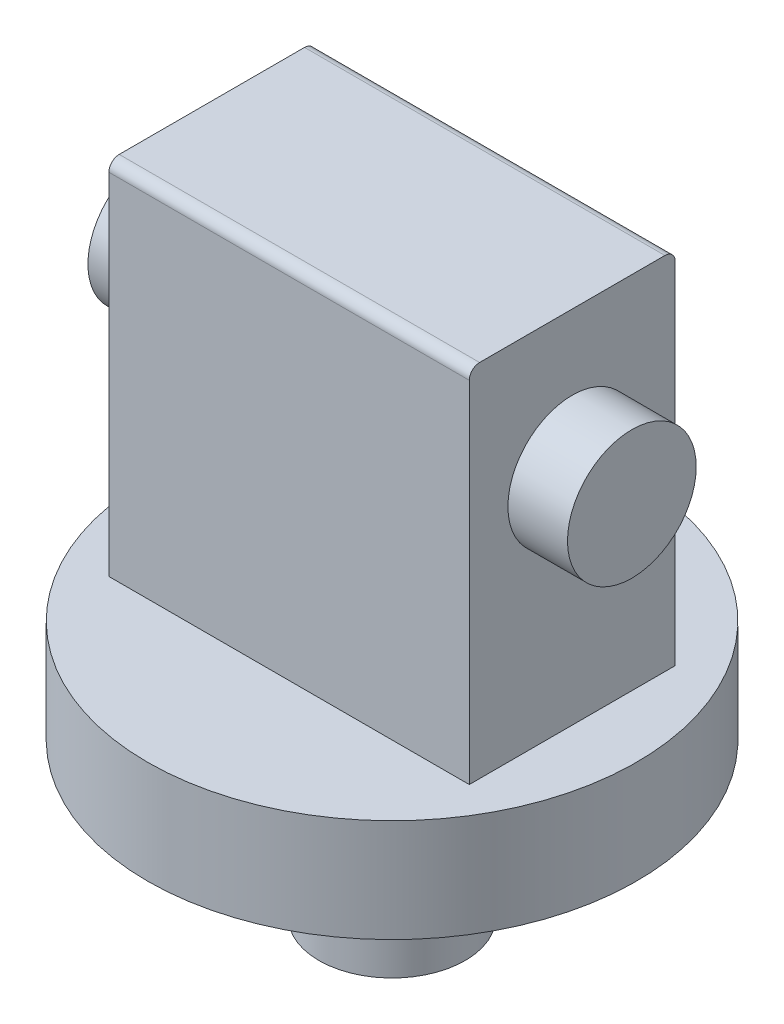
ISO-10303-21;
HEADER;
FILE_DESCRIPTION(('STEP AP214'),'2;1');
FILE_NAME('part.step','',(''),(''),'','','');
FILE_SCHEMA(('AUTOMOTIVE_DESIGN { 1 0 10303 214 1 1 1 1 }'));
ENDSEC;
DATA;
#1=APPLICATION_CONTEXT('core data for automotive mechanical design processes');
#2=APPLICATION_PROTOCOL_DEFINITION('international standard','automotive_design',2000,#1);
#3=PRODUCT_CONTEXT('',#1,'mechanical');
#4=PRODUCT('Part','Part','',(#3));
#5=PRODUCT_RELATED_PRODUCT_CATEGORY('part','',(#4));
#6=PRODUCT_DEFINITION_FORMATION('','',#4);
#7=PRODUCT_DEFINITION_CONTEXT('part definition',#1,'design');
#8=PRODUCT_DEFINITION('design','',#6,#7);
#9=PRODUCT_DEFINITION_SHAPE('','',#8);
#10=(LENGTH_UNIT() NAMED_UNIT(*) SI_UNIT(.MILLI.,.METRE.));
#11=(NAMED_UNIT(*) PLANE_ANGLE_UNIT() SI_UNIT($,.RADIAN.));
#12=(NAMED_UNIT(*) SI_UNIT($,.STERADIAN.) SOLID_ANGLE_UNIT());
#13=UNCERTAINTY_MEASURE_WITH_UNIT(LENGTH_MEASURE(1.E-05),#10,'distance_accuracy_value','');
#14=(GEOMETRIC_REPRESENTATION_CONTEXT(3) GLOBAL_UNCERTAINTY_ASSIGNED_CONTEXT((#13)) GLOBAL_UNIT_ASSIGNED_CONTEXT((#10,
#11,#12)) REPRESENTATION_CONTEXT('',''));
#15=CARTESIAN_POINT('',(0.,0.,0.));
#16=DIRECTION('',(0.,0.,1.));
#17=DIRECTION('',(1.,0.,0.));
#18=AXIS2_PLACEMENT_3D('',#15,#16,#17);
#19=CARTESIAN_POINT('',(0.,25.4,0.));
#20=DIRECTION('',(0.,-1.,0.));
#21=DIRECTION('',(0.,0.,-1.));
#22=AXIS2_PLACEMENT_3D('',#19,#20,#21);
#23=CYLINDRICAL_SURFACE('',#22,60.325);
#24=CARTESIAN_POINT('',(0.,25.4,0.));
#25=DIRECTION('',(0.,1.,0.));
#26=DIRECTION('',(0.,0.,1.));
#27=AXIS2_PLACEMENT_3D('',#24,#25,#26);
#28=CIRCLE('',#27,60.325);
#29=CARTESIAN_POINT('',(0.,25.4,60.325));
#30=VERTEX_POINT('',#29);
#31=EDGE_CURVE('E130',#30,#30,#28,.T.);
#32=ORIENTED_EDGE('',*,*,#31,.F.);
#33=EDGE_LOOP('',(#32));
#34=FACE_BOUND('',#33,.T.);
#35=CARTESIAN_POINT('',(0.,0.,0.));
#36=DIRECTION('',(0.,1.,0.));
#37=DIRECTION('',(0.,0.,1.));
#38=AXIS2_PLACEMENT_3D('',#35,#36,#37);
#39=CIRCLE('',#38,60.325);
#40=CARTESIAN_POINT('',(0.,0.,60.325));
#41=VERTEX_POINT('',#40);
#42=EDGE_CURVE('E129',#41,#41,#39,.T.);
#43=ORIENTED_EDGE('',*,*,#42,.T.);
#44=EDGE_LOOP('',(#43));
#45=FACE_BOUND('',#44,.T.);
#46=ADVANCED_FACE('F41',(#34,#45),#23,.T.);
#47=CARTESIAN_POINT('',(0.,25.4,0.));
#48=DIRECTION('',(0.,1.,0.));
#49=DIRECTION('',(0.,0.,1.));
#50=AXIS2_PLACEMENT_3D('',#47,#48,#49);
#51=PLANE('',#50);
#52=DIRECTION('',(0.,0.,-1.));
#53=VECTOR('',#52,1.);
#54=CARTESIAN_POINT('',(44.45,25.4,-25.4));
#55=LINE('',#54,#53);
#56=CARTESIAN_POINT('',(44.45,25.4,25.4));
#57=VERTEX_POINT('',#56);
#58=CARTESIAN_POINT('',(44.45,25.4,-25.4));
#59=VERTEX_POINT('',#58);
#60=EDGE_CURVE('E116',#57,#59,#55,.T.);
#61=ORIENTED_EDGE('',*,*,#60,.F.);
#62=DIRECTION('',(1.,0.,0.));
#63=VECTOR('',#62,1.);
#64=CARTESIAN_POINT('',(-44.45,25.4,25.4));
#65=LINE('',#64,#63);
#66=CARTESIAN_POINT('',(-44.45,25.4,25.4));
#67=VERTEX_POINT('',#66);
#68=EDGE_CURVE('E113',#67,#57,#65,.T.);
#69=ORIENTED_EDGE('',*,*,#68,.F.);
#70=DIRECTION('',(0.,0.,1.));
#71=VECTOR('',#70,1.);
#72=CARTESIAN_POINT('',(-44.45,25.4,-25.4));
#73=LINE('',#72,#71);
#74=CARTESIAN_POINT('',(-44.45,25.4,-25.4));
#75=VERTEX_POINT('',#74);
#76=EDGE_CURVE('E98',#75,#67,#73,.T.);
#77=ORIENTED_EDGE('',*,*,#76,.F.);
#78=DIRECTION('',(-1.,0.,0.));
#79=VECTOR('',#78,1.);
#80=CARTESIAN_POINT('',(-44.45,25.4,-25.4));
#81=LINE('',#80,#79);
#82=EDGE_CURVE('E110',#59,#75,#81,.T.);
#83=ORIENTED_EDGE('',*,*,#82,.F.);
#84=EDGE_LOOP('',(#61,#69,#77,#83));
#85=FACE_BOUND('',#84,.T.);
#86=ORIENTED_EDGE('',*,*,#31,.T.);
#87=EDGE_LOOP('',(#86));
#88=FACE_BOUND('',#87,.T.);
#89=ADVANCED_FACE('F108',(#85,#88),#51,.T.);
#90=CARTESIAN_POINT('',(0.,0.,0.));
#91=DIRECTION('',(0.,1.,0.));
#92=DIRECTION('',(0.,0.,1.));
#93=AXIS2_PLACEMENT_3D('',#90,#91,#92);
#94=PLANE('',#93);
#95=CARTESIAN_POINT('',(0.,0.,0.));
#96=DIRECTION('',(0.,-1.,0.));
#97=DIRECTION('',(0.,0.,-1.));
#98=AXIS2_PLACEMENT_3D('',#95,#96,#97);
#99=CIRCLE('',#98,18.04999999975);
#100=CARTESIAN_POINT('',(0.,0.,18.04999999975));
#101=VERTEX_POINT('',#100);
#102=EDGE_CURVE('E138',#101,#101,#99,.T.);
#103=ORIENTED_EDGE('',*,*,#102,.F.);
#104=EDGE_LOOP('',(#103));
#105=FACE_BOUND('',#104,.T.);
#106=ORIENTED_EDGE('',*,*,#42,.F.);
#107=EDGE_LOOP('',(#106));
#108=FACE_BOUND('',#107,.T.);
#109=ADVANCED_FACE('F177',(#105,#108),#94,.F.);
#110=CARTESIAN_POINT('',(44.45,114.3,-25.4));
#111=DIRECTION('',(-1.,0.,0.));
#112=DIRECTION('',(0.,0.,1.));
#113=AXIS2_PLACEMENT_3D('',#110,#111,#112);
#114=PLANE('',#113);
#115=CARTESIAN_POINT('',(44.45,80.01,0.));
#116=DIRECTION('',(-1.,0.,0.));
#117=DIRECTION('',(0.,0.,1.));
#118=AXIS2_PLACEMENT_3D('',#115,#116,#117);
#119=CIRCLE('',#118,15.875);
#120=CARTESIAN_POINT('',(44.45,80.01,15.875));
#121=VERTEX_POINT('',#120);
#122=EDGE_CURVE('E133',#121,#121,#119,.F.);
#123=ORIENTED_EDGE('',*,*,#122,.F.);
#124=EDGE_LOOP('',(#123));
#125=FACE_BOUND('',#124,.T.);
#126=DIRECTION('',(0.,-1.,0.));
#127=VECTOR('',#126,1.);
#128=CARTESIAN_POINT('',(44.45,114.3,-25.4));
#129=LINE('',#128,#127);
#130=CARTESIAN_POINT('',(44.45,111.76,-25.4));
#131=VERTEX_POINT('',#130);
#132=EDGE_CURVE('E101',#131,#59,#129,.T.);
#133=ORIENTED_EDGE('',*,*,#132,.F.);
#134=CARTESIAN_POINT('',(44.45,111.76,-22.86));
#135=DIRECTION('',(-1.,0.,0.));
#136=DIRECTION('',(0.,0.,1.));
#137=AXIS2_PLACEMENT_3D('',#134,#135,#136);
#138=CIRCLE('',#137,2.54);
#139=CARTESIAN_POINT('',(44.45,114.3,-22.86));
#140=VERTEX_POINT('',#139);
#141=EDGE_CURVE('E49',#131,#140,#138,.F.);
#142=ORIENTED_EDGE('',*,*,#141,.T.);
#143=DIRECTION('',(0.,0.,-1.));
#144=VECTOR('',#143,1.);
#145=CARTESIAN_POINT('',(44.45,114.3,-25.4));
#146=LINE('',#145,#144);
#147=CARTESIAN_POINT('',(44.45,114.3,22.86));
#148=VERTEX_POINT('',#147);
#149=EDGE_CURVE('E123',#148,#140,#146,.T.);
#150=ORIENTED_EDGE('',*,*,#149,.F.);
#151=CARTESIAN_POINT('',(44.45,111.76,22.86));
#152=DIRECTION('',(-1.,0.,0.));
#153=DIRECTION('',(0.,0.,1.));
#154=AXIS2_PLACEMENT_3D('',#151,#152,#153);
#155=CIRCLE('',#154,2.54);
#156=CARTESIAN_POINT('',(44.45,111.76,25.4));
#157=VERTEX_POINT('',#156);
#158=EDGE_CURVE('E56',#148,#157,#155,.F.);
#159=ORIENTED_EDGE('',*,*,#158,.T.);
#160=DIRECTION('',(0.,-1.,0.));
#161=VECTOR('',#160,1.);
#162=CARTESIAN_POINT('',(44.45,114.3,25.4));
#163=LINE('',#162,#161);
#164=EDGE_CURVE('E124',#157,#57,#163,.T.);
#165=ORIENTED_EDGE('',*,*,#164,.T.);
#166=ORIENTED_EDGE('',*,*,#60,.T.);
#167=EDGE_LOOP('',(#133,#142,#150,#159,#165,#166));
#168=FACE_BOUND('',#167,.T.);
#169=ADVANCED_FACE('F151',(#125,#168),#114,.F.);
#170=CARTESIAN_POINT('',(-44.45,114.3,-25.4));
#171=DIRECTION('',(0.,0.,1.));
#172=DIRECTION('',(1.,0.,0.));
#173=AXIS2_PLACEMENT_3D('',#170,#171,#172);
#174=PLANE('',#173);
#175=DIRECTION('',(0.,-1.,0.));
#176=VECTOR('',#175,1.);
#177=CARTESIAN_POINT('',(-44.45,114.3,-25.4));
#178=LINE('',#177,#176);
#179=CARTESIAN_POINT('',(-44.45,111.76,-25.4));
#180=VERTEX_POINT('',#179);
#181=EDGE_CURVE('E93',#180,#75,#178,.T.);
#182=ORIENTED_EDGE('',*,*,#181,.F.);
#183=DIRECTION('',(-1.,0.,0.));
#184=VECTOR('',#183,1.);
#185=CARTESIAN_POINT('',(44.45,111.76,-25.4));
#186=LINE('',#185,#184);
#187=EDGE_CURVE('E64',#180,#131,#186,.F.);
#188=ORIENTED_EDGE('',*,*,#187,.T.);
#189=ORIENTED_EDGE('',*,*,#132,.T.);
#190=ORIENTED_EDGE('',*,*,#82,.T.);
#191=EDGE_LOOP('',(#182,#188,#189,#190));
#192=FACE_BOUND('',#191,.T.);
#193=ADVANCED_FACE('F115',(#192),#174,.F.);
#194=CARTESIAN_POINT('',(-44.45,114.3,-25.4));
#195=DIRECTION('',(1.,0.,0.));
#196=DIRECTION('',(0.,0.,-1.));
#197=AXIS2_PLACEMENT_3D('',#194,#195,#196);
#198=PLANE('',#197);
#199=CARTESIAN_POINT('',(-44.45,80.01,0.));
#200=DIRECTION('',(1.,0.,0.));
#201=DIRECTION('',(0.,0.,-1.));
#202=AXIS2_PLACEMENT_3D('',#199,#200,#201);
#203=CIRCLE('',#202,15.875);
#204=CARTESIAN_POINT('',(-44.45,80.01,-15.875));
#205=VERTEX_POINT('',#204);
#206=EDGE_CURVE('E230',#205,#205,#203,.T.);
#207=ORIENTED_EDGE('',*,*,#206,.T.);
#208=EDGE_LOOP('',(#207));
#209=FACE_BOUND('',#208,.T.);
#210=DIRECTION('',(0.,0.,1.));
#211=VECTOR('',#210,1.);
#212=CARTESIAN_POINT('',(-44.45,114.3,-25.4));
#213=LINE('',#212,#211);
#214=CARTESIAN_POINT('',(-44.45,114.3,-22.86));
#215=VERTEX_POINT('',#214);
#216=CARTESIAN_POINT('',(-44.45,114.3,22.86));
#217=VERTEX_POINT('',#216);
#218=EDGE_CURVE('E126',#215,#217,#213,.T.);
#219=ORIENTED_EDGE('',*,*,#218,.F.);
#220=CARTESIAN_POINT('',(-44.45,111.76,-22.86));
#221=DIRECTION('',(1.,0.,0.));
#222=DIRECTION('',(0.,0.,-1.));
#223=AXIS2_PLACEMENT_3D('',#220,#221,#222);
#224=CIRCLE('',#223,2.54);
#225=EDGE_CURVE('E99',#215,#180,#224,.F.);
#226=ORIENTED_EDGE('',*,*,#225,.T.);
#227=ORIENTED_EDGE('',*,*,#181,.T.);
#228=ORIENTED_EDGE('',*,*,#76,.T.);
#229=DIRECTION('',(0.,-1.,0.));
#230=VECTOR('',#229,1.);
#231=CARTESIAN_POINT('',(-44.45,114.3,25.4));
#232=LINE('',#231,#230);
#233=CARTESIAN_POINT('',(-44.45,111.76,25.4));
#234=VERTEX_POINT('',#233);
#235=EDGE_CURVE('E102',#234,#67,#232,.T.);
#236=ORIENTED_EDGE('',*,*,#235,.F.);
#237=CARTESIAN_POINT('',(-44.45,111.76,22.86));
#238=DIRECTION('',(1.,0.,0.));
#239=DIRECTION('',(0.,0.,-1.));
#240=AXIS2_PLACEMENT_3D('',#237,#238,#239);
#241=CIRCLE('',#240,2.54);
#242=EDGE_CURVE('E145',#234,#217,#241,.F.);
#243=ORIENTED_EDGE('',*,*,#242,.T.);
#244=EDGE_LOOP('',(#219,#226,#227,#228,#236,#243));
#245=FACE_BOUND('',#244,.T.);
#246=ADVANCED_FACE('F96',(#209,#245),#198,.F.);
#247=CARTESIAN_POINT('',(-44.45,114.3,25.4));
#248=DIRECTION('',(0.,0.,-1.));
#249=DIRECTION('',(-1.,0.,0.));
#250=AXIS2_PLACEMENT_3D('',#247,#248,#249);
#251=PLANE('',#250);
#252=ORIENTED_EDGE('',*,*,#164,.F.);
#253=DIRECTION('',(1.,0.,0.));
#254=VECTOR('',#253,1.);
#255=CARTESIAN_POINT('',(-44.45,111.76,25.4));
#256=LINE('',#255,#254);
#257=EDGE_CURVE('E11',#157,#234,#256,.F.);
#258=ORIENTED_EDGE('',*,*,#257,.T.);
#259=ORIENTED_EDGE('',*,*,#235,.T.);
#260=ORIENTED_EDGE('',*,*,#68,.T.);
#261=EDGE_LOOP('',(#252,#258,#259,#260));
#262=FACE_BOUND('',#261,.T.);
#263=ADVANCED_FACE('F192',(#262),#251,.F.);
#264=CARTESIAN_POINT('',(0.,114.3,0.));
#265=DIRECTION('',(0.,1.,0.));
#266=DIRECTION('',(0.,0.,1.));
#267=AXIS2_PLACEMENT_3D('',#264,#265,#266);
#268=PLANE('',#267);
#269=ORIENTED_EDGE('',*,*,#149,.T.);
#270=DIRECTION('',(-1.,0.,0.));
#271=VECTOR('',#270,1.);
#272=CARTESIAN_POINT('',(-44.45,114.3,-22.86));
#273=LINE('',#272,#271);
#274=EDGE_CURVE('E142',#140,#215,#273,.T.);
#275=ORIENTED_EDGE('',*,*,#274,.T.);
#276=ORIENTED_EDGE('',*,*,#218,.T.);
#277=DIRECTION('',(1.,0.,0.));
#278=VECTOR('',#277,1.);
#279=CARTESIAN_POINT('',(44.45,114.3,22.86));
#280=LINE('',#279,#278);
#281=EDGE_CURVE('E139',#217,#148,#280,.T.);
#282=ORIENTED_EDGE('',*,*,#281,.T.);
#283=EDGE_LOOP('',(#269,#275,#276,#282));
#284=FACE_BOUND('',#283,.T.);
#285=ADVANCED_FACE('F155',(#284),#268,.T.);
#286=CARTESIAN_POINT('',(59.15,80.01,0.));
#287=DIRECTION('',(-1.,0.,0.));
#288=DIRECTION('',(0.,0.,1.));
#289=AXIS2_PLACEMENT_3D('',#286,#287,#288);
#290=CYLINDRICAL_SURFACE('',#289,15.875);
#291=CARTESIAN_POINT('',(59.15,80.01,0.));
#292=DIRECTION('',(1.,0.,0.));
#293=DIRECTION('',(0.,0.,-1.));
#294=AXIS2_PLACEMENT_3D('',#291,#292,#293);
#295=CIRCLE('',#294,15.875);
#296=CARTESIAN_POINT('',(59.15,80.01,-15.875));
#297=VERTEX_POINT('',#296);
#298=EDGE_CURVE('E118',#297,#297,#295,.T.);
#299=ORIENTED_EDGE('',*,*,#298,.F.);
#300=EDGE_LOOP('',(#299));
#301=FACE_BOUND('',#300,.T.);
#302=ORIENTED_EDGE('',*,*,#122,.T.);
#303=EDGE_LOOP('',(#302));
#304=FACE_BOUND('',#303,.T.);
#305=ADVANCED_FACE('F198',(#301,#304),#290,.T.);
#306=CARTESIAN_POINT('',(59.15,80.01,0.));
#307=DIRECTION('',(1.,0.,0.));
#308=DIRECTION('',(0.,0.,-1.));
#309=AXIS2_PLACEMENT_3D('',#306,#307,#308);
#310=PLANE('',#309);
#311=ORIENTED_EDGE('',*,*,#298,.T.);
#312=EDGE_LOOP('',(#311));
#313=FACE_BOUND('',#312,.T.);
#314=ADVANCED_FACE('F201',(#313),#310,.T.);
#315=CARTESIAN_POINT('',(-59.15,80.01,0.));
#316=DIRECTION('',(1.,0.,0.));
#317=DIRECTION('',(0.,0.,-1.));
#318=AXIS2_PLACEMENT_3D('',#315,#316,#317);
#319=CYLINDRICAL_SURFACE('',#318,15.875);
#320=CARTESIAN_POINT('',(-59.15,80.01,0.));
#321=DIRECTION('',(1.,0.,0.));
#322=DIRECTION('',(0.,0.,-1.));
#323=AXIS2_PLACEMENT_3D('',#320,#321,#322);
#324=CIRCLE('',#323,15.875);
#325=CARTESIAN_POINT('',(-59.15,80.01,-15.875));
#326=VERTEX_POINT('',#325);
#327=EDGE_CURVE('E227',#326,#326,#324,.T.);
#328=ORIENTED_EDGE('',*,*,#327,.T.);
#329=EDGE_LOOP('',(#328));
#330=FACE_BOUND('',#329,.T.);
#331=ORIENTED_EDGE('',*,*,#206,.F.);
#332=EDGE_LOOP('',(#331));
#333=FACE_BOUND('',#332,.T.);
#334=ADVANCED_FACE('F205',(#330,#333),#319,.T.);
#335=CARTESIAN_POINT('',(-59.15,80.01,0.));
#336=DIRECTION('',(-1.,0.,0.));
#337=DIRECTION('',(0.,0.,-1.));
#338=AXIS2_PLACEMENT_3D('',#335,#336,#337);
#339=PLANE('',#338);
#340=ORIENTED_EDGE('',*,*,#327,.F.);
#341=EDGE_LOOP('',(#340));
#342=FACE_BOUND('',#341,.T.);
#343=ADVANCED_FACE('F209',(#342),#339,.T.);
#344=CARTESIAN_POINT('',(0.,-38.1,0.));
#345=DIRECTION('',(0.,1.,0.));
#346=DIRECTION('',(0.,0.,1.));
#347=AXIS2_PLACEMENT_3D('',#344,#345,#346);
#348=CYLINDRICAL_SURFACE('',#347,18.04999999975);
#349=CARTESIAN_POINT('',(0.,-38.1,0.));
#350=DIRECTION('',(0.,-1.,0.));
#351=DIRECTION('',(0.,0.,-1.));
#352=AXIS2_PLACEMENT_3D('',#349,#350,#351);
#353=CIRCLE('',#352,18.04999999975);
#354=CARTESIAN_POINT('',(0.,-38.1,18.04999999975));
#355=VERTEX_POINT('',#354);
#356=EDGE_CURVE('E221',#355,#355,#353,.T.);
#357=CARTESIAN_POINT('',(0.,-38.1,18.04999999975));
#358=CARTESIAN_POINT('',(0.,-37.703125,18.04999999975));
#359=CARTESIAN_POINT('',(0.,-37.30625,18.04999999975));
#360=CARTESIAN_POINT('',(0.,-36.5125,18.04999999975));
#361=CARTESIAN_POINT('',(0.,-36.115625,18.04999999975));
#362=CARTESIAN_POINT('',(0.,-35.321875,18.04999999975));
#363=CARTESIAN_POINT('',(0.,-34.925,18.04999999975));
#364=CARTESIAN_POINT('',(0.,-34.13125,18.04999999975));
#365=CARTESIAN_POINT('',(0.,-33.734375,18.04999999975));
#366=CARTESIAN_POINT('',(0.,-32.940625,18.04999999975));
#367=CARTESIAN_POINT('',(0.,-32.54375,18.04999999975));
#368=CARTESIAN_POINT('',(0.,-31.75,18.04999999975));
#369=CARTESIAN_POINT('',(0.,-31.353125,18.04999999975));
#370=CARTESIAN_POINT('',(0.,-30.559375,18.04999999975));
#371=CARTESIAN_POINT('',(0.,-30.1625,18.04999999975));
#372=CARTESIAN_POINT('',(0.,-29.36875,18.04999999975));
#373=CARTESIAN_POINT('',(0.,-28.971875,18.04999999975));
#374=CARTESIAN_POINT('',(0.,-28.178125,18.04999999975));
#375=CARTESIAN_POINT('',(0.,-27.78125,18.04999999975));
#376=CARTESIAN_POINT('',(0.,-26.9875,18.04999999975));
#377=CARTESIAN_POINT('',(0.,-26.590625,18.04999999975));
#378=CARTESIAN_POINT('',(0.,-25.796875,18.04999999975));
#379=CARTESIAN_POINT('',(0.,-25.4,18.04999999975));
#380=CARTESIAN_POINT('',(0.,-24.60625,18.04999999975));
#381=CARTESIAN_POINT('',(0.,-24.209375,18.04999999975));
#382=CARTESIAN_POINT('',(0.,-23.415625,18.04999999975));
#383=CARTESIAN_POINT('',(0.,-23.01875,18.04999999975));
#384=CARTESIAN_POINT('',(0.,-22.225,18.04999999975));
#385=CARTESIAN_POINT('',(0.,-21.828125,18.04999999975));
#386=CARTESIAN_POINT('',(0.,-21.034375,18.04999999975));
#387=CARTESIAN_POINT('',(0.,-20.6375,18.04999999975));
#388=CARTESIAN_POINT('',(0.,-19.84375,18.04999999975));
#389=CARTESIAN_POINT('',(0.,-19.446875,18.04999999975));
#390=CARTESIAN_POINT('',(0.,-18.653125,18.04999999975));
#391=CARTESIAN_POINT('',(0.,-18.25625,18.04999999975));
#392=CARTESIAN_POINT('',(0.,-17.4625,18.04999999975));
#393=CARTESIAN_POINT('',(0.,-17.065625,18.04999999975));
#394=CARTESIAN_POINT('',(0.,-16.271875,18.04999999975));
#395=CARTESIAN_POINT('',(0.,-15.875,18.04999999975));
#396=CARTESIAN_POINT('',(0.,-15.08125,18.04999999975));
#397=CARTESIAN_POINT('',(0.,-14.684375,18.04999999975));
#398=CARTESIAN_POINT('',(0.,-13.890625,18.04999999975));
#399=CARTESIAN_POINT('',(0.,-13.49375,18.04999999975));
#400=CARTESIAN_POINT('',(0.,-12.7,18.04999999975));
#401=CARTESIAN_POINT('',(0.,-12.303125,18.04999999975));
#402=CARTESIAN_POINT('',(0.,-11.509375,18.04999999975));
#403=CARTESIAN_POINT('',(0.,-11.1125,18.04999999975));
#404=CARTESIAN_POINT('',(0.,-10.31875,18.04999999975));
#405=CARTESIAN_POINT('',(0.,-9.92187499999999,18.04999999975));
#406=CARTESIAN_POINT('',(0.,-9.128125,18.04999999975));
#407=CARTESIAN_POINT('',(0.,-8.73124999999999,18.04999999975));
#408=CARTESIAN_POINT('',(0.,-7.93749999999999,18.04999999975));
#409=CARTESIAN_POINT('',(0.,-7.54062499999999,18.04999999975));
#410=CARTESIAN_POINT('',(0.,-6.746875,18.04999999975));
#411=CARTESIAN_POINT('',(0.,-6.35,18.04999999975));
#412=CARTESIAN_POINT('',(0.,-5.55625,18.04999999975));
#413=CARTESIAN_POINT('',(0.,-5.159375,18.04999999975));
#414=CARTESIAN_POINT('',(0.,-4.365625,18.04999999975));
#415=CARTESIAN_POINT('',(0.,-3.96875,18.04999999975));
#416=CARTESIAN_POINT('',(0.,-3.175,18.04999999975));
#417=CARTESIAN_POINT('',(0.,-2.778125,18.04999999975));
#418=CARTESIAN_POINT('',(0.,-1.984375,18.04999999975));
#419=CARTESIAN_POINT('',(0.,-1.5875,18.04999999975));
#420=CARTESIAN_POINT('',(0.,-0.79375,18.04999999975));
#421=CARTESIAN_POINT('',(0.,-0.396875,18.04999999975));
#422=CARTESIAN_POINT('',(0.,0.,18.04999999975));
#423=B_SPLINE_CURVE_WITH_KNOTS('',3,(#357,#358,#359,#360,#361,#362,#363,#364,#365,#366,#367,
#368,#369,#370,#371,#372,#373,#374,#375,#376,#377,#378,#379,#380,#381,#382,#383,#384,#385,#386,
#387,#388,#389,#390,#391,#392,#393,#394,#395,#396,#397,#398,#399,#400,#401,#402,#403,#404,#405,
#406,#407,#408,#409,#410,#411,#412,#413,#414,#415,#416,#417,#418,#419,#420,#421,#422),
.UNSPECIFIED.,.F.,.F.,(4,2,2,2,2,2,2,2,2,2,2,2,2,2,2,2,2,2,2,2,2,2,2,2,2,2,2,2,2,2,2,2,4),(0.,
1.190625,2.38125,3.571875,4.7625,5.953125,7.14375,8.334375,9.52500000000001,10.715625,11.90625,
13.096875,14.2875,15.478125,16.66875,17.859375,19.05,20.240625,21.43125,22.621875,23.8125,
25.003125,26.19375,27.384375,28.575,29.765625,30.95625,32.146875,33.3375,34.528125,35.71875,
36.909375,38.1),.UNSPECIFIED.);
#424=EDGE_CURVE('BSEAM168',#355,#101,#423,.T.);
#425=ORIENTED_EDGE('',*,*,#356,.F.);
#426=ORIENTED_EDGE('',*,*,#102,.T.);
#427=ORIENTED_EDGE('',*,*,#424,.T.);
#428=ORIENTED_EDGE('',*,*,#424,.F.);
#429=EDGE_LOOP('',(#425,#427,#426,#428));
#430=FACE_BOUND('',#429,.T.);
#431=ADVANCED_FACE('F168',(#430),#348,.T.);
#432=CARTESIAN_POINT('',(0.,-38.1,0.));
#433=DIRECTION('',(0.,-1.,0.));
#434=DIRECTION('',(0.,0.,-1.));
#435=AXIS2_PLACEMENT_3D('',#432,#433,#434);
#436=PLANE('',#435);
#437=ORIENTED_EDGE('',*,*,#356,.T.);
#438=EDGE_LOOP('',(#437));
#439=FACE_BOUND('',#438,.T.);
#440=ADVANCED_FACE('F161',(#439),#436,.T.);
#441=CARTESIAN_POINT('',(0.,111.76,-22.86));
#442=DIRECTION('',(1.,0.,0.));
#443=DIRECTION('',(0.,0.,-1.));
#444=AXIS2_PLACEMENT_3D('',#441,#442,#443);
#445=CYLINDRICAL_SURFACE('',#444,2.54);
#446=ORIENTED_EDGE('',*,*,#141,.F.);
#447=ORIENTED_EDGE('',*,*,#187,.F.);
#448=ORIENTED_EDGE('',*,*,#225,.F.);
#449=ORIENTED_EDGE('',*,*,#274,.F.);
#450=EDGE_LOOP('',(#446,#447,#448,#449));
#451=FACE_BOUND('',#450,.T.);
#452=ADVANCED_FACE('F159',(#451),#445,.T.);
#453=CARTESIAN_POINT('',(0.,111.76,22.86));
#454=DIRECTION('',(-1.,0.,0.));
#455=DIRECTION('',(0.,0.,1.));
#456=AXIS2_PLACEMENT_3D('',#453,#454,#455);
#457=CYLINDRICAL_SURFACE('',#456,2.54);
#458=ORIENTED_EDGE('',*,*,#242,.F.);
#459=ORIENTED_EDGE('',*,*,#257,.F.);
#460=ORIENTED_EDGE('',*,*,#158,.F.);
#461=ORIENTED_EDGE('',*,*,#281,.F.);
#462=EDGE_LOOP('',(#458,#459,#460,#461));
#463=FACE_BOUND('',#462,.T.);
#464=ADVANCED_FACE('F43',(#463),#457,.T.);
#465=CLOSED_SHELL('',(#46,#89,#109,#169,#193,#246,#263,#285,#305,#314,#334,#343,#431,#440,#452,#464));
#466=MANIFOLD_SOLID_BREP('B2',#465);
#467=ADVANCED_BREP_SHAPE_REPRESENTATION('',(#18,#466),#14);
#468=SHAPE_DEFINITION_REPRESENTATION(#9,#467);
ENDSEC;
END-ISO-10303-21;
